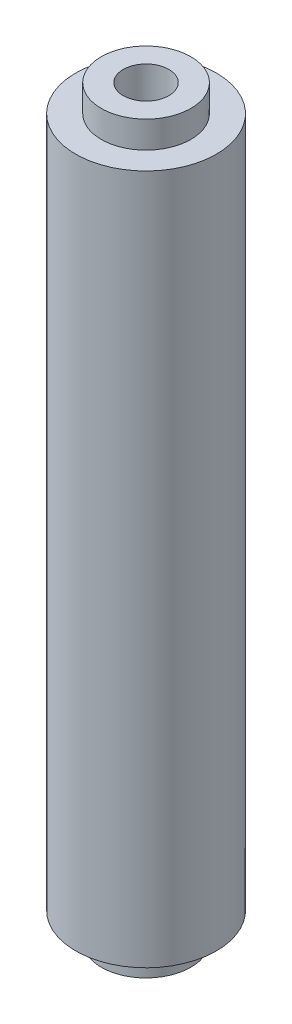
ISO-10303-21;
HEADER;
FILE_DESCRIPTION(('STEP AP214'),'2;1');
FILE_NAME('part.step','',(''),(''),'','','');
FILE_SCHEMA(('AUTOMOTIVE_DESIGN { 1 0 10303 214 1 1 1 1 }'));
ENDSEC;
DATA;
#1=APPLICATION_CONTEXT('core data for automotive mechanical design processes');
#2=APPLICATION_PROTOCOL_DEFINITION('international standard','automotive_design',2000,#1);
#3=PRODUCT_CONTEXT('',#1,'mechanical');
#4=PRODUCT('Part','Part','',(#3));
#5=PRODUCT_RELATED_PRODUCT_CATEGORY('part','',(#4));
#6=PRODUCT_DEFINITION_FORMATION('','',#4);
#7=PRODUCT_DEFINITION_CONTEXT('part definition',#1,'design');
#8=PRODUCT_DEFINITION('design','',#6,#7);
#9=PRODUCT_DEFINITION_SHAPE('','',#8);
#10=(LENGTH_UNIT() NAMED_UNIT(*) SI_UNIT(.MILLI.,.METRE.));
#11=(NAMED_UNIT(*) PLANE_ANGLE_UNIT() SI_UNIT($,.RADIAN.));
#12=(NAMED_UNIT(*) SI_UNIT($,.STERADIAN.) SOLID_ANGLE_UNIT());
#13=UNCERTAINTY_MEASURE_WITH_UNIT(LENGTH_MEASURE(1.E-05),#10,'distance_accuracy_value','');
#14=(GEOMETRIC_REPRESENTATION_CONTEXT(3) GLOBAL_UNCERTAINTY_ASSIGNED_CONTEXT((#13)) GLOBAL_UNIT_ASSIGNED_CONTEXT((#10,
#11,#12)) REPRESENTATION_CONTEXT('',''));
#15=CARTESIAN_POINT('',(0.,0.,0.));
#16=DIRECTION('',(0.,0.,1.));
#17=DIRECTION('',(1.,0.,0.));
#18=AXIS2_PLACEMENT_3D('',#15,#16,#17);
#19=CARTESIAN_POINT('',(-3.96875000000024,-1.77635683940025E-12,0.));
#20=DIRECTION('',(0.,1.,0.));
#21=DIRECTION('',(0.,0.,1.));
#22=AXIS2_PLACEMENT_3D('',#19,#20,#21);
#23=PLANE('',#22);
#24=CARTESIAN_POINT('',(0.,0.,0.));
#25=DIRECTION('',(0.,-1.,0.));
#26=DIRECTION('',(0.,0.,-1.));
#27=AXIS2_PLACEMENT_3D('',#24,#25,#26);
#28=CIRCLE('',#27,3.96875);
#29=CARTESIAN_POINT('',(0.,0.,-3.96874999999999));
#30=VERTEX_POINT('',#29);
#31=EDGE_CURVE('E82',#30,#30,#28,.T.);
#32=ORIENTED_EDGE('',*,*,#31,.T.);
#33=EDGE_LOOP('',(#32));
#34=FACE_BOUND('',#33,.T.);
#35=CARTESIAN_POINT('',(0.,0.,0.));
#36=DIRECTION('',(0.,1.,0.));
#37=DIRECTION('',(0.,0.,1.));
#38=AXIS2_PLACEMENT_3D('',#35,#36,#37);
#39=CIRCLE('',#38,2.0193);
#40=CARTESIAN_POINT('',(0.,0.,2.01930000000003));
#41=VERTEX_POINT('',#40);
#42=EDGE_CURVE('E67',#41,#41,#39,.T.);
#43=ORIENTED_EDGE('',*,*,#42,.T.);
#44=EDGE_LOOP('',(#43));
#45=FACE_BOUND('',#44,.T.);
#46=ADVANCED_FACE('F40',(#34,#45),#23,.F.);
#47=CARTESIAN_POINT('',(2.22044604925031E-13,65.8812499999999,-1.73472347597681E-13));
#48=DIRECTION('',(0.,-1.,0.));
#49=DIRECTION('',(0.,0.,-1.));
#50=AXIS2_PLACEMENT_3D('',#47,#48,#49);
#51=PLANE('',#50);
#52=CARTESIAN_POINT('',(2.22044604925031E-13,65.8812499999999,-1.73472347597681E-13));
#53=DIRECTION('',(0.,-1.,0.));
#54=DIRECTION('',(0.,0.,-1.));
#55=AXIS2_PLACEMENT_3D('',#52,#53,#54);
#56=CIRCLE('',#55,3.96874999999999);
#57=CARTESIAN_POINT('',(2.22815689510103E-13,65.8812499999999,-3.96875000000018));
#58=VERTEX_POINT('',#57);
#59=EDGE_CURVE('E11',#58,#58,#56,.T.);
#60=ORIENTED_EDGE('',*,*,#59,.F.);
#61=EDGE_LOOP('',(#60));
#62=FACE_BOUND('',#61,.T.);
#63=CARTESIAN_POINT('',(2.22044604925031E-13,65.8812499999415,-1.73472347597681E-13));
#64=DIRECTION('',(0.,-1.,0.));
#65=DIRECTION('',(0.,0.,-1.));
#66=AXIS2_PLACEMENT_3D('',#63,#64,#65);
#67=CIRCLE('',#66,2.0193);
#68=CARTESIAN_POINT('',(2.22436932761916E-13,65.8812499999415,-2.01930000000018));
#69=VERTEX_POINT('',#68);
#70=EDGE_CURVE('E66',#69,#69,#67,.T.);
#71=ORIENTED_EDGE('',*,*,#70,.T.);
#72=EDGE_LOOP('',(#71));
#73=FACE_BOUND('',#72,.T.);
#74=ADVANCED_FACE('F42',(#62,#73),#51,.F.);
#75=CARTESIAN_POINT('',(0.,0.,0.));
#76=DIRECTION('',(0.,-1.,0.));
#77=DIRECTION('',(0.,0.,-1.));
#78=AXIS2_PLACEMENT_3D('',#75,#76,#77);
#79=CYLINDRICAL_SURFACE('',#78,3.96874999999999);
#80=CARTESIAN_POINT('',(1.66533453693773E-13,63.4999999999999,-1.94289029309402E-13));
#81=DIRECTION('',(0.,-1.,0.));
#82=DIRECTION('',(0.,0.,-1.));
#83=AXIS2_PLACEMENT_3D('',#80,#81,#82);
#84=CIRCLE('',#83,3.96874999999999);
#85=CARTESIAN_POINT('',(1.67304538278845E-13,63.4999999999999,-3.9687500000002));
#86=VERTEX_POINT('',#85);
#87=EDGE_CURVE('E49',#86,#86,#84,.T.);
#88=ORIENTED_EDGE('',*,*,#87,.F.);
#89=EDGE_LOOP('',(#88));
#90=FACE_BOUND('',#89,.T.);
#91=ORIENTED_EDGE('',*,*,#59,.T.);
#92=EDGE_LOOP('',(#91));
#93=FACE_BOUND('',#92,.T.);
#94=ADVANCED_FACE('F104',(#90,#93),#79,.T.);
#95=CARTESIAN_POINT('',(-3.9687499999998,63.4999999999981,-1.73472347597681E-13));
#96=DIRECTION('',(0.,-1.,0.));
#97=DIRECTION('',(0.,0.,-1.));
#98=AXIS2_PLACEMENT_3D('',#95,#96,#97);
#99=PLANE('',#98);
#100=CARTESIAN_POINT('',(1.66533453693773E-13,63.4999999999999,-1.94289029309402E-13));
#101=DIRECTION('',(0.,-1.,0.));
#102=DIRECTION('',(0.,0.,-1.));
#103=AXIS2_PLACEMENT_3D('',#100,#101,#102);
#104=CIRCLE('',#103,6.23062);
#105=CARTESIAN_POINT('',(1.67743994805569E-13,63.4999999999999,-6.23062000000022));
#106=VERTEX_POINT('',#105);
#107=EDGE_CURVE('E94',#106,#106,#104,.T.);
#108=ORIENTED_EDGE('',*,*,#107,.F.);
#109=EDGE_LOOP('',(#108));
#110=FACE_BOUND('',#109,.T.);
#111=ORIENTED_EDGE('',*,*,#87,.T.);
#112=EDGE_LOOP('',(#111));
#113=FACE_BOUND('',#112,.T.);
#114=ADVANCED_FACE('F102',(#110,#113),#99,.F.);
#115=CARTESIAN_POINT('',(0.,0.,0.));
#116=DIRECTION('',(0.,-1.,0.));
#117=DIRECTION('',(0.,0.,-1.));
#118=AXIS2_PLACEMENT_3D('',#115,#116,#117);
#119=CYLINDRICAL_SURFACE('',#118,6.23061999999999);
#120=CARTESIAN_POINT('',(0.,2.38125,0.));
#121=DIRECTION('',(0.,-1.,0.));
#122=DIRECTION('',(0.,0.,-1.));
#123=AXIS2_PLACEMENT_3D('',#120,#121,#122);
#124=CIRCLE('',#123,6.23061999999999);
#125=CARTESIAN_POINT('',(0.,2.38125,-6.23062000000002));
#126=VERTEX_POINT('',#125);
#127=EDGE_CURVE('E90',#126,#126,#124,.T.);
#128=ORIENTED_EDGE('',*,*,#127,.F.);
#129=EDGE_LOOP('',(#128));
#130=FACE_BOUND('',#129,.T.);
#131=ORIENTED_EDGE('',*,*,#107,.T.);
#132=EDGE_LOOP('',(#131));
#133=FACE_BOUND('',#132,.T.);
#134=ADVANCED_FACE('F135',(#130,#133),#119,.T.);
#135=CARTESIAN_POINT('',(-6.23061999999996,2.38124999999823,0.));
#136=DIRECTION('',(0.,1.,0.));
#137=DIRECTION('',(0.,0.,1.));
#138=AXIS2_PLACEMENT_3D('',#135,#136,#137);
#139=PLANE('',#138);
#140=CARTESIAN_POINT('',(0.,2.38125,0.));
#141=DIRECTION('',(0.,-1.,0.));
#142=DIRECTION('',(0.,0.,-1.));
#143=AXIS2_PLACEMENT_3D('',#140,#141,#142);
#144=CIRCLE('',#143,3.96875);
#145=CARTESIAN_POINT('',(0.,2.38125,-3.96875000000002));
#146=VERTEX_POINT('',#145);
#147=EDGE_CURVE('E86',#146,#146,#144,.T.);
#148=ORIENTED_EDGE('',*,*,#147,.F.);
#149=EDGE_LOOP('',(#148));
#150=FACE_BOUND('',#149,.T.);
#151=ORIENTED_EDGE('',*,*,#127,.T.);
#152=EDGE_LOOP('',(#151));
#153=FACE_BOUND('',#152,.T.);
#154=ADVANCED_FACE('F131',(#150,#153),#139,.F.);
#155=CARTESIAN_POINT('',(0.,0.,0.));
#156=DIRECTION('',(0.,-1.,0.));
#157=DIRECTION('',(0.,0.,-1.));
#158=AXIS2_PLACEMENT_3D('',#155,#156,#157);
#159=CYLINDRICAL_SURFACE('',#158,3.96875);
#160=ORIENTED_EDGE('',*,*,#31,.F.);
#161=EDGE_LOOP('',(#160));
#162=FACE_BOUND('',#161,.T.);
#163=ORIENTED_EDGE('',*,*,#147,.T.);
#164=EDGE_LOOP('',(#163));
#165=FACE_BOUND('',#164,.T.);
#166=ADVANCED_FACE('F120',(#162,#165),#159,.T.);
#167=CARTESIAN_POINT('',(0.,42.0687499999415,-1.87350135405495E-13));
#168=DIRECTION('',(0.,1.,0.));
#169=DIRECTION('',(0.,0.,1.));
#170=AXIS2_PLACEMENT_3D('',#167,#168,#169);
#171=CONICAL_SURFACE('',#170,2.0193,1.08210413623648);
#172=CARTESIAN_POINT('',(-2.22044604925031E-13,40.9950691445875,-1.2490009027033E-13));
#173=VERTEX_POINT('',#172);
#174=VERTEX_LOOP('',#173);
#175=FACE_BOUND('',#174,.T.);
#176=CARTESIAN_POINT('',(0.,42.0687499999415,-1.87350135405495E-13));
#177=DIRECTION('',(0.,-1.,0.));
#178=DIRECTION('',(0.,0.,-1.));
#179=AXIS2_PLACEMENT_3D('',#176,#177,#178);
#180=CIRCLE('',#179,2.0193);
#181=CARTESIAN_POINT('',(0.,42.0687499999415,-2.0193000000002));
#182=VERTEX_POINT('',#181);
#183=EDGE_CURVE('E73',#182,#182,#180,.T.);
#184=ORIENTED_EDGE('',*,*,#183,.F.);
#185=EDGE_LOOP('',(#184));
#186=FACE_BOUND('',#185,.T.);
#187=ADVANCED_FACE('F114',(#175,#186),#171,.F.);
#188=CARTESIAN_POINT('',(2.22044604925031E-13,65.8812499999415,-1.73472347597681E-13));
#189=DIRECTION('',(0.,-1.,0.));
#190=DIRECTION('',(0.,0.,-1.));
#191=AXIS2_PLACEMENT_3D('',#188,#189,#190);
#192=CYLINDRICAL_SURFACE('',#191,2.0193);
#193=ORIENTED_EDGE('',*,*,#183,.T.);
#194=EDGE_LOOP('',(#193));
#195=FACE_BOUND('',#194,.T.);
#196=ORIENTED_EDGE('',*,*,#70,.F.);
#197=EDGE_LOOP('',(#196));
#198=FACE_BOUND('',#197,.T.);
#199=ADVANCED_FACE('F59',(#195,#198),#192,.F.);
#200=CARTESIAN_POINT('',(-1.38777878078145E-13,23.8125,0.));
#201=DIRECTION('',(0.,-1.,0.));
#202=DIRECTION('',(0.,0.,-1.));
#203=AXIS2_PLACEMENT_3D('',#200,#201,#202);
#204=CONICAL_SURFACE('',#203,2.0193,1.08210413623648);
#205=CARTESIAN_POINT('',(-2.22044604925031E-13,24.886180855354,-1.73472347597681E-13));
#206=VERTEX_POINT('',#205);
#207=VERTEX_LOOP('',#206);
#208=FACE_BOUND('',#207,.T.);
#209=CARTESIAN_POINT('',(-1.38777878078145E-13,23.8125,0.));
#210=DIRECTION('',(0.,1.,0.));
#211=DIRECTION('',(0.,0.,1.));
#212=AXIS2_PLACEMENT_3D('',#209,#210,#211);
#213=CIRCLE('',#212,2.0193);
#214=CARTESIAN_POINT('',(-1.39170205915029E-13,23.8125,2.01929999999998));
#215=VERTEX_POINT('',#214);
#216=EDGE_CURVE('E63',#215,#215,#213,.T.);
#217=ORIENTED_EDGE('',*,*,#216,.F.);
#218=EDGE_LOOP('',(#217));
#219=FACE_BOUND('',#218,.T.);
#220=ADVANCED_FACE('F55',(#208,#219),#204,.F.);
#221=CARTESIAN_POINT('',(0.,0.,0.));
#222=DIRECTION('',(0.,1.,0.));
#223=DIRECTION('',(0.,0.,1.));
#224=AXIS2_PLACEMENT_3D('',#221,#222,#223);
#225=CYLINDRICAL_SURFACE('',#224,2.0193);
#226=ORIENTED_EDGE('',*,*,#216,.T.);
#227=EDGE_LOOP('',(#226));
#228=FACE_BOUND('',#227,.T.);
#229=ORIENTED_EDGE('',*,*,#42,.F.);
#230=EDGE_LOOP('',(#229));
#231=FACE_BOUND('',#230,.T.);
#232=ADVANCED_FACE('F58',(#228,#231),#225,.F.);
#233=CLOSED_SHELL('',(#46,#74,#94,#114,#134,#154,#166,#187,#199,#220,#232));
#234=MANIFOLD_SOLID_BREP('B2',#233);
#235=ADVANCED_BREP_SHAPE_REPRESENTATION('',(#18,#234),#14);
#236=SHAPE_DEFINITION_REPRESENTATION(#9,#235);
ENDSEC;
END-ISO-10303-21;
